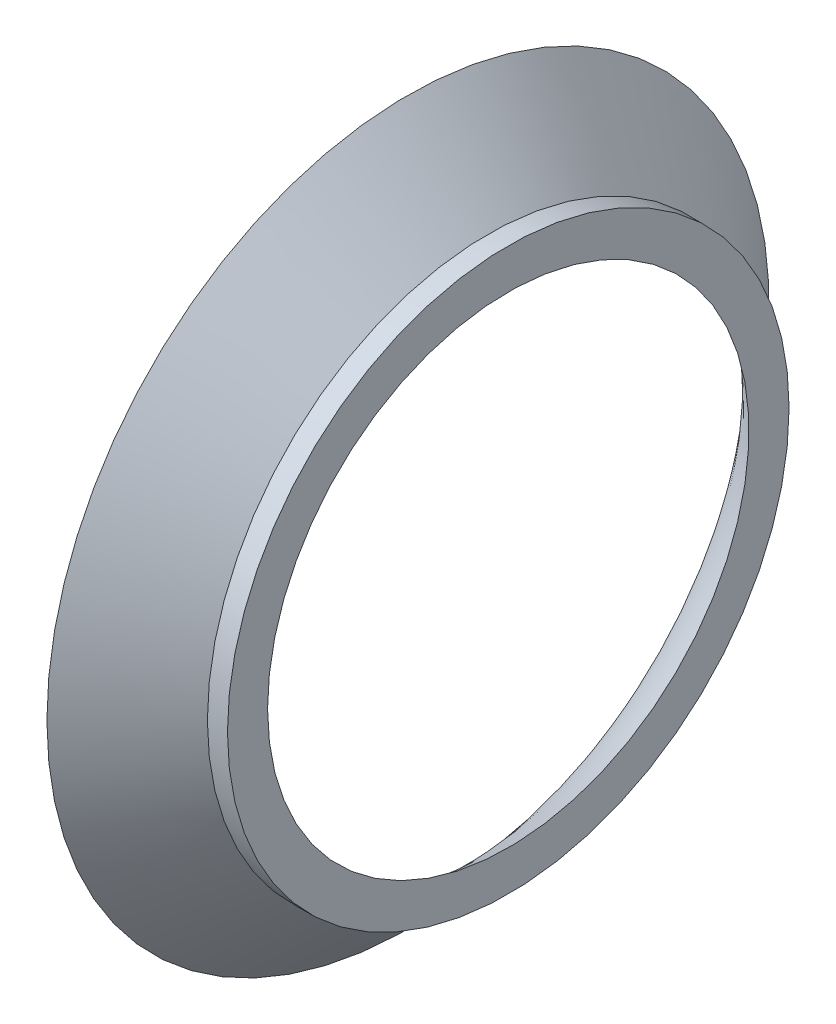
from build123d import *


with BuildPart() as part:
    # Esquisse1 → R_volution1 (revolve)
    with BuildSketch(Plane.XY, mode=Mode.PRIVATE) as r_volution1_sk:
        with BuildLine():
            Line((-1, 14), (-5, 18))
            ThreePointArc((-5, 18), (-2.897363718, 14.668863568), (0, 12))
            Line((0, 12), (0, 14))
            Line((0, 14), (-1, 14))
        make_face()
    revolve(r_volution1_sk.sketch.rotate(Axis((0, 0, 0), (1, 0, 0)), 90), axis=Axis((0, 0, 0), (1, 0, 0)))


solid = part.part
